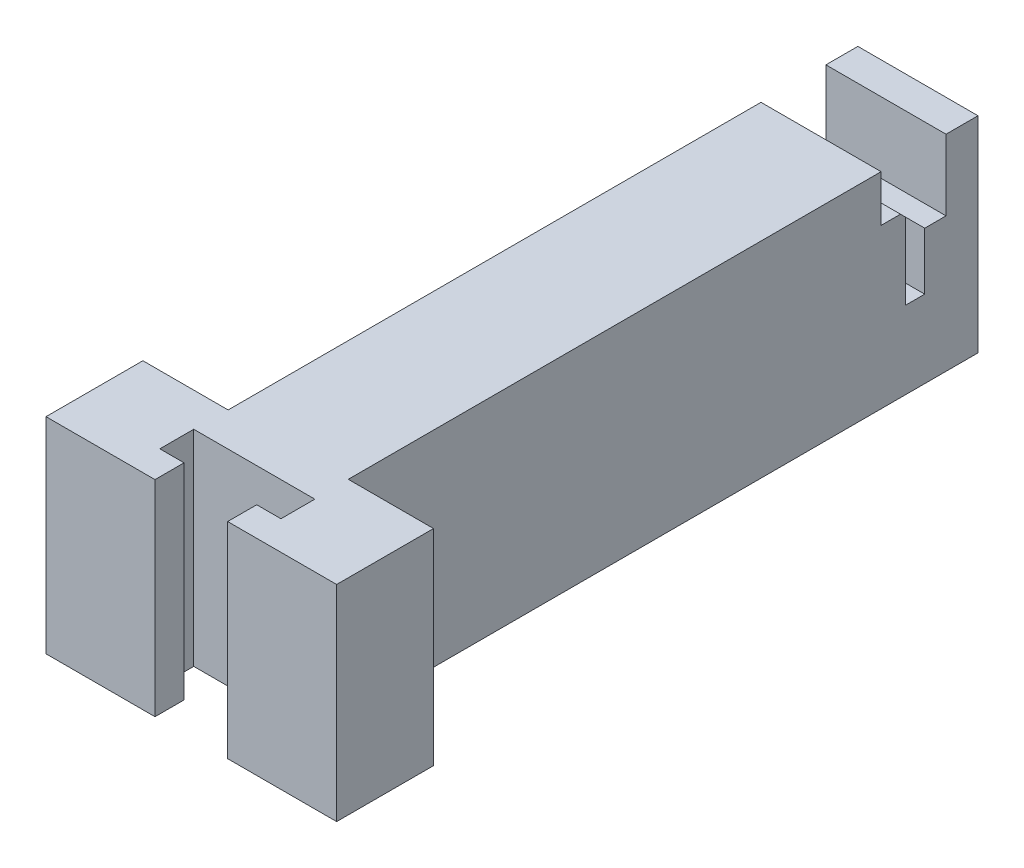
ISO-10303-21;
HEADER;
FILE_DESCRIPTION(('STEP AP214'),'2;1');
FILE_NAME('part.step','',(''),(''),'','','');
FILE_SCHEMA(('AUTOMOTIVE_DESIGN { 1 0 10303 214 1 1 1 1 }'));
ENDSEC;
DATA;
#1=APPLICATION_CONTEXT('core data for automotive mechanical design processes');
#2=APPLICATION_PROTOCOL_DEFINITION('international standard','automotive_design',2000,#1);
#3=PRODUCT_CONTEXT('',#1,'mechanical');
#4=PRODUCT('Part','Part','',(#3));
#5=PRODUCT_RELATED_PRODUCT_CATEGORY('part','',(#4));
#6=PRODUCT_DEFINITION_FORMATION('','',#4);
#7=PRODUCT_DEFINITION_CONTEXT('part definition',#1,'design');
#8=PRODUCT_DEFINITION('design','',#6,#7);
#9=PRODUCT_DEFINITION_SHAPE('','',#8);
#10=(LENGTH_UNIT() NAMED_UNIT(*) SI_UNIT(.MILLI.,.METRE.));
#11=(NAMED_UNIT(*) PLANE_ANGLE_UNIT() SI_UNIT($,.RADIAN.));
#12=(NAMED_UNIT(*) SI_UNIT($,.STERADIAN.) SOLID_ANGLE_UNIT());
#13=UNCERTAINTY_MEASURE_WITH_UNIT(LENGTH_MEASURE(1.E-05),#10,'distance_accuracy_value','');
#14=(GEOMETRIC_REPRESENTATION_CONTEXT(3) GLOBAL_UNCERTAINTY_ASSIGNED_CONTEXT((#13)) GLOBAL_UNIT_ASSIGNED_CONTEXT((#10,
#11,#12)) REPRESENTATION_CONTEXT('',''));
#15=CARTESIAN_POINT('',(0.,0.,0.));
#16=DIRECTION('',(0.,0.,1.));
#17=DIRECTION('',(1.,0.,0.));
#18=AXIS2_PLACEMENT_3D('',#15,#16,#17);
#19=CARTESIAN_POINT('',(0.,1.13686837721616E-13,75.));
#20=DIRECTION('',(1.,0.,0.));
#21=DIRECTION('',(0.,0.,-1.));
#22=AXIS2_PLACEMENT_3D('',#19,#20,#21);
#23=PLANE('',#22);
#24=DIRECTION('',(0.,1.,0.));
#25=VECTOR('',#24,1.);
#26=CARTESIAN_POINT('',(1.81898940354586E-12,-53.8,65.));
#27=LINE('',#26,#25);
#28=CARTESIAN_POINT('',(1.81898940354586E-12,1.11022302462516E-13,65.));
#29=VERTEX_POINT('',#28);
#30=CARTESIAN_POINT('',(1.81972492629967E-12,21.2,65.));
#31=VERTEX_POINT('',#30);
#32=EDGE_CURVE('E205',#29,#31,#27,.T.);
#33=ORIENTED_EDGE('',*,*,#32,.F.);
#34=DIRECTION('',(0.,0.,-1.));
#35=VECTOR('',#34,1.);
#36=CARTESIAN_POINT('',(0.,1.13686837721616E-13,75.));
#37=LINE('',#36,#35);
#38=CARTESIAN_POINT('',(0.,1.13686837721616E-13,75.));
#39=VERTEX_POINT('',#38);
#40=EDGE_CURVE('E372',#39,#29,#37,.T.);
#41=ORIENTED_EDGE('',*,*,#40,.F.);
#42=DIRECTION('',(0.,-1.,0.));
#43=VECTOR('',#42,1.);
#44=CARTESIAN_POINT('',(0.,1.13686837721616E-13,75.));
#45=LINE('',#44,#43);
#46=CARTESIAN_POINT('',(0.,21.2,75.));
#47=VERTEX_POINT('',#46);
#48=EDGE_CURVE('E346',#47,#39,#45,.T.);
#49=ORIENTED_EDGE('',*,*,#48,.F.);
#50=DIRECTION('',(0.,0.,-1.));
#51=VECTOR('',#50,1.);
#52=CARTESIAN_POINT('',(0.,21.2,75.));
#53=LINE('',#52,#51);
#54=EDGE_CURVE('E359',#47,#31,#53,.T.);
#55=ORIENTED_EDGE('',*,*,#54,.T.);
#56=EDGE_LOOP('',(#33,#41,#49,#55));
#57=FACE_BOUND('',#56,.T.);
#58=ADVANCED_FACE('F34',(#57),#23,.F.);
#59=CARTESIAN_POINT('',(30.,1.13686837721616E-13,75.));
#60=DIRECTION('',(-1.,0.,0.));
#61=DIRECTION('',(0.,0.,1.));
#62=AXIS2_PLACEMENT_3D('',#59,#60,#61);
#63=PLANE('',#62);
#64=DIRECTION('',(0.,1.,0.));
#65=VECTOR('',#64,1.);
#66=CARTESIAN_POINT('',(30.0000000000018,-53.8,65.));
#67=LINE('',#66,#65);
#68=CARTESIAN_POINT('',(30.0000000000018,1.11022302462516E-13,65.));
#69=VERTEX_POINT('',#68);
#70=CARTESIAN_POINT('',(30.0000000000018,21.2,65.));
#71=VERTEX_POINT('',#70);
#72=EDGE_CURVE('E258',#69,#71,#67,.T.);
#73=ORIENTED_EDGE('',*,*,#72,.T.);
#74=DIRECTION('',(0.,0.,-1.));
#75=VECTOR('',#74,1.);
#76=CARTESIAN_POINT('',(30.,21.2,75.));
#77=LINE('',#76,#75);
#78=CARTESIAN_POINT('',(30.,21.2,75.));
#79=VERTEX_POINT('',#78);
#80=EDGE_CURVE('E366',#79,#71,#77,.T.);
#81=ORIENTED_EDGE('',*,*,#80,.F.);
#82=DIRECTION('',(0.,1.,0.));
#83=VECTOR('',#82,1.);
#84=CARTESIAN_POINT('',(30.,1.13686837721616E-13,75.));
#85=LINE('',#84,#83);
#86=CARTESIAN_POINT('',(30.,1.13686837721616E-13,75.));
#87=VERTEX_POINT('',#86);
#88=EDGE_CURVE('E354',#87,#79,#85,.T.);
#89=ORIENTED_EDGE('',*,*,#88,.F.);
#90=DIRECTION('',(0.,0.,-1.));
#91=VECTOR('',#90,1.);
#92=CARTESIAN_POINT('',(30.,1.13686837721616E-13,75.));
#93=LINE('',#92,#91);
#94=EDGE_CURVE('E369',#87,#69,#93,.T.);
#95=ORIENTED_EDGE('',*,*,#94,.T.);
#96=EDGE_LOOP('',(#73,#81,#89,#95));
#97=FACE_BOUND('',#96,.T.);
#98=ADVANCED_FACE('F442',(#97),#63,.F.);
#99=CARTESIAN_POINT('',(0.,21.2,75.));
#100=DIRECTION('',(0.,-1.,0.));
#101=DIRECTION('',(0.,0.,-1.));
#102=AXIS2_PLACEMENT_3D('',#99,#100,#101);
#103=PLANE('',#102);
#104=DIRECTION('',(0.,0.,1.));
#105=VECTOR('',#104,1.);
#106=CARTESIAN_POINT('',(8.80000000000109,21.2,65.));
#107=LINE('',#106,#105);
#108=CARTESIAN_POINT('',(8.80000000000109,21.2,0.));
#109=VERTEX_POINT('',#108);
#110=CARTESIAN_POINT('',(8.80000000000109,21.2,3.29999999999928));
#111=VERTEX_POINT('',#110);
#112=EDGE_CURVE('E246',#109,#111,#107,.T.);
#113=ORIENTED_EDGE('',*,*,#112,.T.);
#114=DIRECTION('',(1.,0.,0.));
#115=VECTOR('',#114,1.);
#116=CARTESIAN_POINT('',(-45.,21.1999999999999,3.29999999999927));
#117=LINE('',#116,#115);
#118=CARTESIAN_POINT('',(21.2000000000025,21.2,3.29999999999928));
#119=VERTEX_POINT('',#118);
#120=EDGE_CURVE('E338',#111,#119,#117,.T.);
#121=ORIENTED_EDGE('',*,*,#120,.T.);
#122=DIRECTION('',(0.,0.,-1.));
#123=VECTOR('',#122,1.);
#124=CARTESIAN_POINT('',(21.2000000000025,21.2,65.));
#125=LINE('',#124,#123);
#126=CARTESIAN_POINT('',(21.2000000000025,21.2,0.));
#127=VERTEX_POINT('',#126);
#128=EDGE_CURVE('E241',#119,#127,#125,.T.);
#129=ORIENTED_EDGE('',*,*,#128,.T.);
#130=DIRECTION('',(-1.,0.,0.));
#131=VECTOR('',#130,1.);
#132=CARTESIAN_POINT('',(0.,21.2,0.));
#133=LINE('',#132,#131);
#134=EDGE_CURVE('E350',#127,#109,#133,.T.);
#135=ORIENTED_EDGE('',*,*,#134,.T.);
#136=EDGE_LOOP('',(#113,#121,#129,#135));
#137=FACE_BOUND('',#136,.T.);
#138=ADVANCED_FACE('F412',(#137),#103,.F.);
#139=DIRECTION('',(-1.,0.,0.));
#140=VECTOR('',#139,1.);
#141=CARTESIAN_POINT('',(1.81898940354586E-12,21.2,65.));
#142=LINE('',#141,#140);
#143=CARTESIAN_POINT('',(8.80000000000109,21.2,65.));
#144=VERTEX_POINT('',#143);
#145=EDGE_CURVE('E221',#144,#31,#142,.T.);
#146=ORIENTED_EDGE('',*,*,#145,.T.);
#147=ORIENTED_EDGE('',*,*,#54,.F.);
#148=DIRECTION('',(-1.,0.,0.));
#149=VECTOR('',#148,1.);
#150=CARTESIAN_POINT('',(0.,21.2,75.));
#151=LINE('',#150,#149);
#152=CARTESIAN_POINT('',(11.2500000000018,21.2,75.));
#153=VERTEX_POINT('',#152);
#154=EDGE_CURVE('E220',#153,#47,#151,.T.);
#155=ORIENTED_EDGE('',*,*,#154,.F.);
#156=DIRECTION('',(0.,0.,-1.));
#157=VECTOR('',#156,1.);
#158=CARTESIAN_POINT('',(11.2500000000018,21.2,75.));
#159=LINE('',#158,#157);
#160=CARTESIAN_POINT('',(11.2500000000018,21.2,72.));
#161=VERTEX_POINT('',#160);
#162=EDGE_CURVE('E48',#153,#161,#159,.T.);
#163=ORIENTED_EDGE('',*,*,#162,.T.);
#164=DIRECTION('',(-1.,0.,0.));
#165=VECTOR('',#164,1.);
#166=CARTESIAN_POINT('',(8.75000000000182,21.2,72.));
#167=LINE('',#166,#165);
#168=CARTESIAN_POINT('',(8.75000000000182,21.2,72.));
#169=VERTEX_POINT('',#168);
#170=EDGE_CURVE('E208',#161,#169,#167,.T.);
#171=ORIENTED_EDGE('',*,*,#170,.T.);
#172=DIRECTION('',(0.,0.,-1.));
#173=VECTOR('',#172,1.);
#174=CARTESIAN_POINT('',(8.75000000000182,21.2,72.));
#175=LINE('',#174,#173);
#176=CARTESIAN_POINT('',(8.75000000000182,21.2,68.5));
#177=VERTEX_POINT('',#176);
#178=EDGE_CURVE('E214',#169,#177,#175,.T.);
#179=ORIENTED_EDGE('',*,*,#178,.T.);
#180=DIRECTION('',(1.,0.,0.));
#181=VECTOR('',#180,1.);
#182=CARTESIAN_POINT('',(8.75000000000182,21.2,68.5));
#183=LINE('',#182,#181);
#184=CARTESIAN_POINT('',(21.2500000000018,21.2,68.5));
#185=VERTEX_POINT('',#184);
#186=EDGE_CURVE('E226',#177,#185,#183,.T.);
#187=ORIENTED_EDGE('',*,*,#186,.T.);
#188=DIRECTION('',(0.,0.,1.));
#189=VECTOR('',#188,1.);
#190=CARTESIAN_POINT('',(21.2500000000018,21.2,72.));
#191=LINE('',#190,#189);
#192=CARTESIAN_POINT('',(21.2500000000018,21.2,72.));
#193=VERTEX_POINT('',#192);
#194=EDGE_CURVE('E229',#185,#193,#191,.T.);
#195=ORIENTED_EDGE('',*,*,#194,.T.);
#196=DIRECTION('',(-1.,0.,0.));
#197=VECTOR('',#196,1.);
#198=CARTESIAN_POINT('',(18.7500000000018,21.2,72.));
#199=LINE('',#198,#197);
#200=CARTESIAN_POINT('',(18.7500000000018,21.2,72.));
#201=VERTEX_POINT('',#200);
#202=EDGE_CURVE('E232',#193,#201,#199,.T.);
#203=ORIENTED_EDGE('',*,*,#202,.T.);
#204=DIRECTION('',(0.,0.,1.));
#205=VECTOR('',#204,1.);
#206=CARTESIAN_POINT('',(18.7500000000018,21.2,72.));
#207=LINE('',#206,#205);
#208=CARTESIAN_POINT('',(18.7500000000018,21.2,75.));
#209=VERTEX_POINT('',#208);
#210=EDGE_CURVE('E235',#201,#209,#207,.T.);
#211=ORIENTED_EDGE('',*,*,#210,.T.);
#212=EDGE_CURVE('E356',#79,#209,#151,.T.);
#213=ORIENTED_EDGE('',*,*,#212,.F.);
#214=ORIENTED_EDGE('',*,*,#80,.T.);
#215=DIRECTION('',(-1.,0.,0.));
#216=VECTOR('',#215,1.);
#217=CARTESIAN_POINT('',(21.2000000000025,21.2,65.));
#218=LINE('',#217,#216);
#219=CARTESIAN_POINT('',(21.2000000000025,21.2,65.));
#220=VERTEX_POINT('',#219);
#221=EDGE_CURVE('E238',#71,#220,#218,.T.);
#222=ORIENTED_EDGE('',*,*,#221,.T.);
#223=CARTESIAN_POINT('',(21.2000000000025,21.2,9.99999999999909));
#224=VERTEX_POINT('',#223);
#225=EDGE_CURVE('E242',#220,#224,#125,.T.);
#226=ORIENTED_EDGE('',*,*,#225,.T.);
#227=DIRECTION('',(1.,0.,0.));
#228=VECTOR('',#227,1.);
#229=CARTESIAN_POINT('',(-45.,21.1999999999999,9.99999999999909));
#230=LINE('',#229,#228);
#231=CARTESIAN_POINT('',(8.80000000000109,21.1999999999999,9.99999999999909));
#232=VERTEX_POINT('',#231);
#233=EDGE_CURVE('E341',#232,#224,#230,.T.);
#234=ORIENTED_EDGE('',*,*,#233,.F.);
#235=EDGE_CURVE('E245',#232,#144,#107,.T.);
#236=ORIENTED_EDGE('',*,*,#235,.T.);
#237=EDGE_LOOP('',(#146,#147,#155,#163,#171,#179,#187,#195,#203,#211,#213,#214,#222,#226,#234,#236));
#238=FACE_BOUND('',#237,.T.);
#239=ADVANCED_FACE('F218',(#238),#103,.F.);
#240=CARTESIAN_POINT('',(0.,1.13686837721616E-13,75.));
#241=DIRECTION('',(0.,1.,0.));
#242=DIRECTION('',(0.,0.,1.));
#243=AXIS2_PLACEMENT_3D('',#240,#241,#242);
#244=PLANE('',#243);
#245=DIRECTION('',(-1.,0.,0.));
#246=VECTOR('',#245,1.);
#247=CARTESIAN_POINT('',(0.,1.13686837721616E-13,65.));
#248=LINE('',#247,#246);
#249=CARTESIAN_POINT('',(8.80000000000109,1.11022302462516E-13,65.));
#250=VERTEX_POINT('',#249);
#251=EDGE_CURVE('E12',#250,#29,#248,.T.);
#252=ORIENTED_EDGE('',*,*,#251,.F.);
#253=DIRECTION('',(0.,0.,1.));
#254=VECTOR('',#253,1.);
#255=CARTESIAN_POINT('',(8.80000000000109,1.13686837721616E-13,75.));
#256=LINE('',#255,#254);
#257=CARTESIAN_POINT('',(8.80000000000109,1.17961196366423E-13,0.));
#258=VERTEX_POINT('',#257);
#259=EDGE_CURVE('E313',#258,#250,#256,.T.);
#260=ORIENTED_EDGE('',*,*,#259,.F.);
#261=DIRECTION('',(1.,0.,0.));
#262=VECTOR('',#261,1.);
#263=CARTESIAN_POINT('',(0.,1.13686837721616E-13,0.));
#264=LINE('',#263,#262);
#265=CARTESIAN_POINT('',(21.2000000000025,1.17961196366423E-13,0.));
#266=VERTEX_POINT('',#265);
#267=EDGE_CURVE('E322',#258,#266,#264,.T.);
#268=ORIENTED_EDGE('',*,*,#267,.T.);
#269=DIRECTION('',(0.,0.,-1.));
#270=VECTOR('',#269,1.);
#271=CARTESIAN_POINT('',(21.2000000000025,1.13686837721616E-13,75.));
#272=LINE('',#271,#270);
#273=CARTESIAN_POINT('',(21.2000000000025,1.11022302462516E-13,65.));
#274=VERTEX_POINT('',#273);
#275=EDGE_CURVE('E290',#274,#266,#272,.T.);
#276=ORIENTED_EDGE('',*,*,#275,.F.);
#277=DIRECTION('',(-1.,0.,0.));
#278=VECTOR('',#277,1.);
#279=CARTESIAN_POINT('',(0.,1.13686837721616E-13,65.));
#280=LINE('',#279,#278);
#281=EDGE_CURVE('E41',#69,#274,#280,.T.);
#282=ORIENTED_EDGE('',*,*,#281,.F.);
#283=ORIENTED_EDGE('',*,*,#94,.F.);
#284=DIRECTION('',(1.,0.,0.));
#285=VECTOR('',#284,1.);
#286=CARTESIAN_POINT('',(0.,1.13686837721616E-13,75.));
#287=LINE('',#286,#285);
#288=CARTESIAN_POINT('',(18.7500000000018,1.17961196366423E-13,75.));
#289=VERTEX_POINT('',#288);
#290=EDGE_CURVE('E349',#289,#87,#287,.T.);
#291=ORIENTED_EDGE('',*,*,#290,.F.);
#292=DIRECTION('',(0.,0.,1.));
#293=VECTOR('',#292,1.);
#294=CARTESIAN_POINT('',(18.7500000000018,1.13686837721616E-13,75.));
#295=LINE('',#294,#293);
#296=CARTESIAN_POINT('',(18.7500000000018,1.11022302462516E-13,72.));
#297=VERTEX_POINT('',#296);
#298=EDGE_CURVE('E316',#297,#289,#295,.T.);
#299=ORIENTED_EDGE('',*,*,#298,.F.);
#300=DIRECTION('',(-1.,0.,0.));
#301=VECTOR('',#300,1.);
#302=CARTESIAN_POINT('',(0.,1.13686837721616E-13,72.));
#303=LINE('',#302,#301);
#304=CARTESIAN_POINT('',(21.2500000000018,1.11022302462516E-13,72.));
#305=VERTEX_POINT('',#304);
#306=EDGE_CURVE('E392',#305,#297,#303,.T.);
#307=ORIENTED_EDGE('',*,*,#306,.F.);
#308=DIRECTION('',(0.,0.,1.));
#309=VECTOR('',#308,1.);
#310=CARTESIAN_POINT('',(21.2500000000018,1.13686837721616E-13,75.));
#311=LINE('',#310,#309);
#312=CARTESIAN_POINT('',(21.2500000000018,1.11022302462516E-13,68.5));
#313=VERTEX_POINT('',#312);
#314=EDGE_CURVE('E390',#313,#305,#311,.T.);
#315=ORIENTED_EDGE('',*,*,#314,.F.);
#316=DIRECTION('',(1.,0.,0.));
#317=VECTOR('',#316,1.);
#318=CARTESIAN_POINT('',(0.,1.13686837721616E-13,68.5));
#319=LINE('',#318,#317);
#320=CARTESIAN_POINT('',(8.75000000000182,1.11022302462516E-13,68.5));
#321=VERTEX_POINT('',#320);
#322=EDGE_CURVE('E388',#321,#313,#319,.T.);
#323=ORIENTED_EDGE('',*,*,#322,.F.);
#324=DIRECTION('',(0.,0.,-1.));
#325=VECTOR('',#324,1.);
#326=CARTESIAN_POINT('',(8.75000000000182,1.13686837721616E-13,75.));
#327=LINE('',#326,#325);
#328=CARTESIAN_POINT('',(8.75000000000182,1.11022302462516E-13,72.));
#329=VERTEX_POINT('',#328);
#330=EDGE_CURVE('E386',#329,#321,#327,.T.);
#331=ORIENTED_EDGE('',*,*,#330,.F.);
#332=DIRECTION('',(-1.,0.,0.));
#333=VECTOR('',#332,1.);
#334=CARTESIAN_POINT('',(0.,1.13686837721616E-13,72.));
#335=LINE('',#334,#333);
#336=CARTESIAN_POINT('',(11.2500000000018,1.11022302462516E-13,72.));
#337=VERTEX_POINT('',#336);
#338=EDGE_CURVE('E384',#337,#329,#335,.T.);
#339=ORIENTED_EDGE('',*,*,#338,.F.);
#340=DIRECTION('',(0.,0.,-1.));
#341=VECTOR('',#340,1.);
#342=CARTESIAN_POINT('',(11.2500000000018,1.13686837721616E-13,75.));
#343=LINE('',#342,#341);
#344=CARTESIAN_POINT('',(11.2500000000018,1.17961196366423E-13,75.));
#345=VERTEX_POINT('',#344);
#346=EDGE_CURVE('E201',#345,#337,#343,.T.);
#347=ORIENTED_EDGE('',*,*,#346,.F.);
#348=EDGE_CURVE('E351',#39,#345,#287,.T.);
#349=ORIENTED_EDGE('',*,*,#348,.F.);
#350=ORIENTED_EDGE('',*,*,#40,.T.);
#351=EDGE_LOOP('',(#252,#260,#268,#276,#282,#283,#291,#299,#307,#315,#323,#331,#339,#347,#349,#350));
#352=FACE_BOUND('',#351,.T.);
#353=ADVANCED_FACE('F404',(#352),#244,.F.);
#354=CARTESIAN_POINT('',(0.,21.2,75.));
#355=DIRECTION('',(0.,0.,-1.));
#356=DIRECTION('',(-1.,0.,0.));
#357=AXIS2_PLACEMENT_3D('',#354,#355,#356);
#358=PLANE('',#357);
#359=DIRECTION('',(0.,1.,0.));
#360=VECTOR('',#359,1.);
#361=CARTESIAN_POINT('',(18.7500000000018,21.2,75.));
#362=LINE('',#361,#360);
#363=EDGE_CURVE('E382',#289,#209,#362,.T.);
#364=ORIENTED_EDGE('',*,*,#363,.F.);
#365=ORIENTED_EDGE('',*,*,#290,.T.);
#366=ORIENTED_EDGE('',*,*,#88,.T.);
#367=ORIENTED_EDGE('',*,*,#212,.T.);
#368=EDGE_LOOP('',(#364,#365,#366,#367));
#369=FACE_BOUND('',#368,.T.);
#370=ADVANCED_FACE('F449',(#369),#358,.F.);
#371=DIRECTION('',(0.,-1.,0.));
#372=VECTOR('',#371,1.);
#373=CARTESIAN_POINT('',(11.2500000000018,21.2,75.));
#374=LINE('',#373,#372);
#375=EDGE_CURVE('E380',#153,#345,#374,.T.);
#376=ORIENTED_EDGE('',*,*,#375,.F.);
#377=ORIENTED_EDGE('',*,*,#154,.T.);
#378=ORIENTED_EDGE('',*,*,#48,.T.);
#379=ORIENTED_EDGE('',*,*,#348,.T.);
#380=EDGE_LOOP('',(#376,#377,#378,#379));
#381=FACE_BOUND('',#380,.T.);
#382=ADVANCED_FACE('F472',(#381),#358,.F.);
#383=CARTESIAN_POINT('',(0.,21.2,0.));
#384=DIRECTION('',(0.,0.,-1.));
#385=DIRECTION('',(-1.,0.,0.));
#386=AXIS2_PLACEMENT_3D('',#383,#384,#385);
#387=PLANE('',#386);
#388=ORIENTED_EDGE('',*,*,#267,.F.);
#389=DIRECTION('',(0.,1.,0.));
#390=VECTOR('',#389,1.);
#391=CARTESIAN_POINT('',(8.80000000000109,-53.8,0.));
#392=LINE('',#391,#390);
#393=EDGE_CURVE('E251',#258,#109,#392,.T.);
#394=ORIENTED_EDGE('',*,*,#393,.T.);
#395=ORIENTED_EDGE('',*,*,#134,.F.);
#396=DIRECTION('',(0.,1.,0.));
#397=VECTOR('',#396,1.);
#398=CARTESIAN_POINT('',(21.2000000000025,-53.8,0.));
#399=LINE('',#398,#397);
#400=EDGE_CURVE('E254',#266,#127,#399,.T.);
#401=ORIENTED_EDGE('',*,*,#400,.F.);
#402=EDGE_LOOP('',(#388,#394,#395,#401));
#403=FACE_BOUND('',#402,.T.);
#404=ADVANCED_FACE('F408',(#403),#387,.T.);
#405=CARTESIAN_POINT('',(-45.,16.4000000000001,9.99999999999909));
#406=DIRECTION('',(0.,1.,0.));
#407=DIRECTION('',(0.,0.,1.));
#408=AXIS2_PLACEMENT_3D('',#405,#406,#407);
#409=PLANE('',#408);
#410=DIRECTION('',(1.,0.,0.));
#411=VECTOR('',#410,1.);
#412=CARTESIAN_POINT('',(-45.,16.4000000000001,7.99999999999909));
#413=LINE('',#412,#411);
#414=CARTESIAN_POINT('',(8.80000000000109,16.4000000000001,7.99999999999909));
#415=VERTEX_POINT('',#414);
#416=CARTESIAN_POINT('',(21.2000000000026,16.4000000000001,7.99999999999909));
#417=VERTEX_POINT('',#416);
#418=EDGE_CURVE('E319',#415,#417,#413,.T.);
#419=ORIENTED_EDGE('',*,*,#418,.F.);
#420=DIRECTION('',(0.,0.,1.));
#421=VECTOR('',#420,1.);
#422=CARTESIAN_POINT('',(8.80000000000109,16.4000000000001,9.99999999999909));
#423=LINE('',#422,#421);
#424=CARTESIAN_POINT('',(8.80000000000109,16.4000000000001,9.99999999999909));
#425=VERTEX_POINT('',#424);
#426=EDGE_CURVE('E292',#415,#425,#423,.T.);
#427=ORIENTED_EDGE('',*,*,#426,.T.);
#428=DIRECTION('',(1.,0.,0.));
#429=VECTOR('',#428,1.);
#430=CARTESIAN_POINT('',(-45.,16.4000000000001,9.99999999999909));
#431=LINE('',#430,#429);
#432=CARTESIAN_POINT('',(21.2000000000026,16.4000000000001,9.99999999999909));
#433=VERTEX_POINT('',#432);
#434=EDGE_CURVE('E318',#425,#433,#431,.T.);
#435=ORIENTED_EDGE('',*,*,#434,.T.);
#436=DIRECTION('',(0.,0.,-1.));
#437=VECTOR('',#436,1.);
#438=CARTESIAN_POINT('',(21.2000000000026,16.4000000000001,9.99999999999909));
#439=LINE('',#438,#437);
#440=EDGE_CURVE('E56',#433,#417,#439,.T.);
#441=ORIENTED_EDGE('',*,*,#440,.T.);
#442=EDGE_LOOP('',(#419,#427,#435,#441));
#443=FACE_BOUND('',#442,.T.);
#444=ADVANCED_FACE('F433',(#443),#409,.T.);
#445=CARTESIAN_POINT('',(-45.,16.4000000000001,7.99999999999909));
#446=DIRECTION('',(0.,0.707106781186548,-0.707106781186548));
#447=DIRECTION('',(0.,0.707106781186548,0.707106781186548));
#448=AXIS2_PLACEMENT_3D('',#445,#446,#447);
#449=PLANE('',#448);
#450=DIRECTION('',(1.,0.,0.));
#451=VECTOR('',#450,1.);
#452=CARTESIAN_POINT('',(-45.,15.9000000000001,7.49999999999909));
#453=LINE('',#452,#451);
#454=CARTESIAN_POINT('',(8.80000000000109,15.9000000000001,7.49999999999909));
#455=VERTEX_POINT('',#454);
#456=CARTESIAN_POINT('',(21.2000000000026,15.9000000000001,7.49999999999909));
#457=VERTEX_POINT('',#456);
#458=EDGE_CURVE('E323',#455,#457,#453,.T.);
#459=ORIENTED_EDGE('',*,*,#458,.F.);
#460=DIRECTION('',(0.,0.707106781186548,0.707106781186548));
#461=VECTOR('',#460,1.);
#462=CARTESIAN_POINT('',(8.80000000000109,16.4000000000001,7.99999999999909));
#463=LINE('',#462,#461);
#464=EDGE_CURVE('E295',#455,#415,#463,.T.);
#465=ORIENTED_EDGE('',*,*,#464,.T.);
#466=ORIENTED_EDGE('',*,*,#418,.T.);
#467=DIRECTION('',(0.,-0.707106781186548,-0.707106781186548));
#468=VECTOR('',#467,1.);
#469=CARTESIAN_POINT('',(21.2000000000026,16.4000000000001,7.99999999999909));
#470=LINE('',#469,#468);
#471=EDGE_CURVE('E272',#417,#457,#470,.T.);
#472=ORIENTED_EDGE('',*,*,#471,.T.);
#473=EDGE_LOOP('',(#459,#465,#466,#472));
#474=FACE_BOUND('',#473,.T.);
#475=ADVANCED_FACE('F430',(#474),#449,.T.);
#476=CARTESIAN_POINT('',(-45.,8.,7.49999999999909));
#477=DIRECTION('',(0.,0.,-1.));
#478=DIRECTION('',(-1.,0.,0.));
#479=AXIS2_PLACEMENT_3D('',#476,#477,#478);
#480=PLANE('',#479);
#481=DIRECTION('',(1.,0.,0.));
#482=VECTOR('',#481,1.);
#483=CARTESIAN_POINT('',(-45.,8.,7.49999999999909));
#484=LINE('',#483,#482);
#485=CARTESIAN_POINT('',(8.80000000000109,8.,7.49999999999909));
#486=VERTEX_POINT('',#485);
#487=CARTESIAN_POINT('',(21.2000000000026,8.,7.49999999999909));
#488=VERTEX_POINT('',#487);
#489=EDGE_CURVE('E326',#486,#488,#484,.T.);
#490=ORIENTED_EDGE('',*,*,#489,.F.);
#491=DIRECTION('',(0.,1.,0.));
#492=VECTOR('',#491,1.);
#493=CARTESIAN_POINT('',(8.80000000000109,8.,7.49999999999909));
#494=LINE('',#493,#492);
#495=EDGE_CURVE('E298',#486,#455,#494,.T.);
#496=ORIENTED_EDGE('',*,*,#495,.T.);
#497=ORIENTED_EDGE('',*,*,#458,.T.);
#498=DIRECTION('',(0.,-1.,0.));
#499=VECTOR('',#498,1.);
#500=CARTESIAN_POINT('',(21.2000000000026,8.,7.49999999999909));
#501=LINE('',#500,#499);
#502=EDGE_CURVE('E275',#457,#488,#501,.T.);
#503=ORIENTED_EDGE('',*,*,#502,.T.);
#504=EDGE_LOOP('',(#490,#496,#497,#503));
#505=FACE_BOUND('',#504,.T.);
#506=ADVANCED_FACE('F427',(#505),#480,.T.);
#507=CARTESIAN_POINT('',(-45.,8.,7.49999999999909));
#508=DIRECTION('',(0.,1.,0.));
#509=DIRECTION('',(0.,0.,1.));
#510=AXIS2_PLACEMENT_3D('',#507,#508,#509);
#511=PLANE('',#510);
#512=DIRECTION('',(1.,0.,0.));
#513=VECTOR('',#512,1.);
#514=CARTESIAN_POINT('',(-45.,8.,5.49999999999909));
#515=LINE('',#514,#513);
#516=CARTESIAN_POINT('',(8.80000000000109,8.,5.49999999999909));
#517=VERTEX_POINT('',#516);
#518=CARTESIAN_POINT('',(21.2000000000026,8.,5.49999999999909));
#519=VERTEX_POINT('',#518);
#520=EDGE_CURVE('E329',#517,#519,#515,.T.);
#521=ORIENTED_EDGE('',*,*,#520,.F.);
#522=DIRECTION('',(0.,0.,1.));
#523=VECTOR('',#522,1.);
#524=CARTESIAN_POINT('',(8.80000000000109,8.,7.49999999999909));
#525=LINE('',#524,#523);
#526=EDGE_CURVE('E301',#517,#486,#525,.T.);
#527=ORIENTED_EDGE('',*,*,#526,.T.);
#528=ORIENTED_EDGE('',*,*,#489,.T.);
#529=DIRECTION('',(0.,0.,-1.));
#530=VECTOR('',#529,1.);
#531=CARTESIAN_POINT('',(21.2000000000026,8.,7.49999999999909));
#532=LINE('',#531,#530);
#533=EDGE_CURVE('E278',#488,#519,#532,.T.);
#534=ORIENTED_EDGE('',*,*,#533,.T.);
#535=EDGE_LOOP('',(#521,#527,#528,#534));
#536=FACE_BOUND('',#535,.T.);
#537=ADVANCED_FACE('F424',(#536),#511,.T.);
#538=CARTESIAN_POINT('',(-45.,8.,5.49999999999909));
#539=DIRECTION('',(0.,-1.54066966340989E-13,1.));
#540=DIRECTION('',(0.,-1.,-1.54066966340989E-13));
#541=AXIS2_PLACEMENT_3D('',#538,#539,#540);
#542=PLANE('',#541);
#543=DIRECTION('',(1.,0.,0.));
#544=VECTOR('',#543,1.);
#545=CARTESIAN_POINT('',(-45.,13.9000000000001,5.5));
#546=LINE('',#545,#544);
#547=CARTESIAN_POINT('',(8.80000000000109,13.9000000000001,5.5));
#548=VERTEX_POINT('',#547);
#549=CARTESIAN_POINT('',(21.2000000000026,13.9000000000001,5.5));
#550=VERTEX_POINT('',#549);
#551=EDGE_CURVE('E332',#548,#550,#546,.T.);
#552=ORIENTED_EDGE('',*,*,#551,.F.);
#553=DIRECTION('',(0.,-1.,-1.54066966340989E-13));
#554=VECTOR('',#553,1.);
#555=CARTESIAN_POINT('',(8.80000000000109,8.,5.49999999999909));
#556=LINE('',#555,#554);
#557=EDGE_CURVE('E304',#548,#517,#556,.T.);
#558=ORIENTED_EDGE('',*,*,#557,.T.);
#559=ORIENTED_EDGE('',*,*,#520,.T.);
#560=DIRECTION('',(0.,1.,1.54066966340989E-13));
#561=VECTOR('',#560,1.);
#562=CARTESIAN_POINT('',(21.2000000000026,8.,5.49999999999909));
#563=LINE('',#562,#561);
#564=EDGE_CURVE('E281',#519,#550,#563,.T.);
#565=ORIENTED_EDGE('',*,*,#564,.T.);
#566=EDGE_LOOP('',(#552,#558,#559,#565));
#567=FACE_BOUND('',#566,.T.);
#568=ADVANCED_FACE('F421',(#567),#542,.T.);
#569=CARTESIAN_POINT('',(-45.,13.9000000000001,5.5));
#570=DIRECTION('',(0.,1.,0.));
#571=DIRECTION('',(0.,0.,1.));
#572=AXIS2_PLACEMENT_3D('',#569,#570,#571);
#573=PLANE('',#572);
#574=DIRECTION('',(1.,0.,0.));
#575=VECTOR('',#574,1.);
#576=CARTESIAN_POINT('',(-45.,13.9000000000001,3.29999999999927));
#577=LINE('',#576,#575);
#578=CARTESIAN_POINT('',(8.80000000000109,13.9000000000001,3.29999999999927));
#579=VERTEX_POINT('',#578);
#580=CARTESIAN_POINT('',(21.2000000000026,13.9000000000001,3.29999999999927));
#581=VERTEX_POINT('',#580);
#582=EDGE_CURVE('E335',#579,#581,#577,.T.);
#583=ORIENTED_EDGE('',*,*,#582,.F.);
#584=DIRECTION('',(0.,0.,1.));
#585=VECTOR('',#584,1.);
#586=CARTESIAN_POINT('',(8.80000000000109,13.9000000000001,5.5));
#587=LINE('',#586,#585);
#588=EDGE_CURVE('E307',#579,#548,#587,.T.);
#589=ORIENTED_EDGE('',*,*,#588,.T.);
#590=ORIENTED_EDGE('',*,*,#551,.T.);
#591=DIRECTION('',(0.,0.,-1.));
#592=VECTOR('',#591,1.);
#593=CARTESIAN_POINT('',(21.2000000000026,13.9000000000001,5.5));
#594=LINE('',#593,#592);
#595=EDGE_CURVE('E284',#550,#581,#594,.T.);
#596=ORIENTED_EDGE('',*,*,#595,.T.);
#597=EDGE_LOOP('',(#583,#589,#590,#596));
#598=FACE_BOUND('',#597,.T.);
#599=ADVANCED_FACE('F418',(#598),#573,.T.);
#600=CARTESIAN_POINT('',(-45.,13.9000000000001,3.29999999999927));
#601=DIRECTION('',(0.,0.,1.));
#602=DIRECTION('',(1.,0.,0.));
#603=AXIS2_PLACEMENT_3D('',#600,#601,#602);
#604=PLANE('',#603);
#605=ORIENTED_EDGE('',*,*,#120,.F.);
#606=DIRECTION('',(0.,-1.,0.));
#607=VECTOR('',#606,1.);
#608=CARTESIAN_POINT('',(8.80000000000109,13.9000000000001,3.29999999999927));
#609=LINE('',#608,#607);
#610=EDGE_CURVE('E310',#111,#579,#609,.T.);
#611=ORIENTED_EDGE('',*,*,#610,.T.);
#612=ORIENTED_EDGE('',*,*,#582,.T.);
#613=DIRECTION('',(0.,1.,0.));
#614=VECTOR('',#613,1.);
#615=CARTESIAN_POINT('',(21.2000000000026,13.9000000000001,3.29999999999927));
#616=LINE('',#615,#614);
#617=EDGE_CURVE('E287',#581,#119,#616,.T.);
#618=ORIENTED_EDGE('',*,*,#617,.T.);
#619=EDGE_LOOP('',(#605,#611,#612,#618));
#620=FACE_BOUND('',#619,.T.);
#621=ADVANCED_FACE('F415',(#620),#604,.T.);
#622=CARTESIAN_POINT('',(-45.,16.4000000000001,9.99999999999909));
#623=DIRECTION('',(0.,0.,-1.));
#624=DIRECTION('',(-1.,0.,0.));
#625=AXIS2_PLACEMENT_3D('',#622,#623,#624);
#626=PLANE('',#625);
#627=ORIENTED_EDGE('',*,*,#434,.F.);
#628=DIRECTION('',(0.,1.,0.));
#629=VECTOR('',#628,1.);
#630=CARTESIAN_POINT('',(8.80000000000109,16.4000000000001,9.99999999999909));
#631=LINE('',#630,#629);
#632=EDGE_CURVE('E377',#425,#232,#631,.T.);
#633=ORIENTED_EDGE('',*,*,#632,.T.);
#634=ORIENTED_EDGE('',*,*,#233,.T.);
#635=DIRECTION('',(0.,-1.,0.));
#636=VECTOR('',#635,1.);
#637=CARTESIAN_POINT('',(21.2000000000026,16.4000000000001,9.99999999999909));
#638=LINE('',#637,#636);
#639=EDGE_CURVE('E375',#224,#433,#638,.T.);
#640=ORIENTED_EDGE('',*,*,#639,.T.);
#641=EDGE_LOOP('',(#627,#633,#634,#640));
#642=FACE_BOUND('',#641,.T.);
#643=ADVANCED_FACE('F436',(#642),#626,.T.);
#644=CARTESIAN_POINT('',(21.2000000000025,-53.8,65.));
#645=DIRECTION('',(1.,0.,0.));
#646=DIRECTION('',(0.,0.,-1.));
#647=AXIS2_PLACEMENT_3D('',#644,#645,#646);
#648=PLANE('',#647);
#649=ORIENTED_EDGE('',*,*,#275,.T.);
#650=ORIENTED_EDGE('',*,*,#400,.T.);
#651=ORIENTED_EDGE('',*,*,#128,.F.);
#652=ORIENTED_EDGE('',*,*,#617,.F.);
#653=ORIENTED_EDGE('',*,*,#595,.F.);
#654=ORIENTED_EDGE('',*,*,#564,.F.);
#655=ORIENTED_EDGE('',*,*,#533,.F.);
#656=ORIENTED_EDGE('',*,*,#502,.F.);
#657=ORIENTED_EDGE('',*,*,#471,.F.);
#658=ORIENTED_EDGE('',*,*,#440,.F.);
#659=ORIENTED_EDGE('',*,*,#639,.F.);
#660=ORIENTED_EDGE('',*,*,#225,.F.);
#661=DIRECTION('',(0.,1.,0.));
#662=VECTOR('',#661,1.);
#663=CARTESIAN_POINT('',(21.2000000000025,-53.8,65.));
#664=LINE('',#663,#662);
#665=EDGE_CURVE('E256',#274,#220,#664,.T.);
#666=ORIENTED_EDGE('',*,*,#665,.F.);
#667=EDGE_LOOP('',(#649,#650,#651,#652,#653,#654,#655,#656,#657,#658,#659,#660,#666));
#668=FACE_BOUND('',#667,.T.);
#669=ADVANCED_FACE('F401',(#668),#648,.T.);
#670=CARTESIAN_POINT('',(21.2000000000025,-53.8,65.));
#671=DIRECTION('',(0.,0.,-1.));
#672=DIRECTION('',(-1.,0.,0.));
#673=AXIS2_PLACEMENT_3D('',#670,#671,#672);
#674=PLANE('',#673);
#675=ORIENTED_EDGE('',*,*,#281,.T.);
#676=ORIENTED_EDGE('',*,*,#665,.T.);
#677=ORIENTED_EDGE('',*,*,#221,.F.);
#678=ORIENTED_EDGE('',*,*,#72,.F.);
#679=EDGE_LOOP('',(#675,#676,#677,#678));
#680=FACE_BOUND('',#679,.T.);
#681=ADVANCED_FACE('F396',(#680),#674,.T.);
#682=CARTESIAN_POINT('',(8.80000000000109,-53.8,65.));
#683=DIRECTION('',(-1.,0.,0.));
#684=DIRECTION('',(0.,0.,1.));
#685=AXIS2_PLACEMENT_3D('',#682,#683,#684);
#686=PLANE('',#685);
#687=ORIENTED_EDGE('',*,*,#259,.T.);
#688=DIRECTION('',(0.,1.,0.));
#689=VECTOR('',#688,1.);
#690=CARTESIAN_POINT('',(8.80000000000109,-53.8,65.));
#691=LINE('',#690,#689);
#692=EDGE_CURVE('E249',#250,#144,#691,.T.);
#693=ORIENTED_EDGE('',*,*,#692,.T.);
#694=ORIENTED_EDGE('',*,*,#235,.F.);
#695=ORIENTED_EDGE('',*,*,#632,.F.);
#696=ORIENTED_EDGE('',*,*,#426,.F.);
#697=ORIENTED_EDGE('',*,*,#464,.F.);
#698=ORIENTED_EDGE('',*,*,#495,.F.);
#699=ORIENTED_EDGE('',*,*,#526,.F.);
#700=ORIENTED_EDGE('',*,*,#557,.F.);
#701=ORIENTED_EDGE('',*,*,#588,.F.);
#702=ORIENTED_EDGE('',*,*,#610,.F.);
#703=ORIENTED_EDGE('',*,*,#112,.F.);
#704=ORIENTED_EDGE('',*,*,#393,.F.);
#705=EDGE_LOOP('',(#687,#693,#694,#695,#696,#697,#698,#699,#700,#701,#702,#703,#704));
#706=FACE_BOUND('',#705,.T.);
#707=ADVANCED_FACE('F482',(#706),#686,.T.);
#708=CARTESIAN_POINT('',(1.81898940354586E-12,-53.8,65.));
#709=DIRECTION('',(0.,0.,-1.));
#710=DIRECTION('',(-1.,0.,0.));
#711=AXIS2_PLACEMENT_3D('',#708,#709,#710);
#712=PLANE('',#711);
#713=ORIENTED_EDGE('',*,*,#251,.T.);
#714=ORIENTED_EDGE('',*,*,#32,.T.);
#715=ORIENTED_EDGE('',*,*,#145,.F.);
#716=ORIENTED_EDGE('',*,*,#692,.F.);
#717=EDGE_LOOP('',(#713,#714,#715,#716));
#718=FACE_BOUND('',#717,.T.);
#719=ADVANCED_FACE('F479',(#718),#712,.T.);
#720=CARTESIAN_POINT('',(18.7500000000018,-53.8,72.));
#721=DIRECTION('',(0.,0.,-1.));
#722=DIRECTION('',(-1.,0.,0.));
#723=AXIS2_PLACEMENT_3D('',#720,#721,#722);
#724=PLANE('',#723);
#725=ORIENTED_EDGE('',*,*,#306,.T.);
#726=DIRECTION('',(0.,1.,0.));
#727=VECTOR('',#726,1.);
#728=CARTESIAN_POINT('',(18.7500000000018,-53.8,72.));
#729=LINE('',#728,#727);
#730=EDGE_CURVE('E261',#297,#201,#729,.T.);
#731=ORIENTED_EDGE('',*,*,#730,.T.);
#732=ORIENTED_EDGE('',*,*,#202,.F.);
#733=DIRECTION('',(0.,1.,0.));
#734=VECTOR('',#733,1.);
#735=CARTESIAN_POINT('',(21.2500000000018,-53.8,72.));
#736=LINE('',#735,#734);
#737=EDGE_CURVE('E263',#305,#193,#736,.T.);
#738=ORIENTED_EDGE('',*,*,#737,.F.);
#739=EDGE_LOOP('',(#725,#731,#732,#738));
#740=FACE_BOUND('',#739,.T.);
#741=ADVANCED_FACE('F458',(#740),#724,.T.);
#742=CARTESIAN_POINT('',(21.2500000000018,-53.8,72.));
#743=DIRECTION('',(-1.,0.,0.));
#744=DIRECTION('',(0.,0.,1.));
#745=AXIS2_PLACEMENT_3D('',#742,#743,#744);
#746=PLANE('',#745);
#747=ORIENTED_EDGE('',*,*,#314,.T.);
#748=ORIENTED_EDGE('',*,*,#737,.T.);
#749=ORIENTED_EDGE('',*,*,#194,.F.);
#750=DIRECTION('',(0.,1.,0.));
#751=VECTOR('',#750,1.);
#752=CARTESIAN_POINT('',(21.2500000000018,-53.8,68.5));
#753=LINE('',#752,#751);
#754=EDGE_CURVE('E265',#313,#185,#753,.T.);
#755=ORIENTED_EDGE('',*,*,#754,.F.);
#756=EDGE_LOOP('',(#747,#748,#749,#755));
#757=FACE_BOUND('',#756,.T.);
#758=ADVANCED_FACE('F464',(#757),#746,.T.);
#759=CARTESIAN_POINT('',(8.75000000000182,-53.8,68.5));
#760=DIRECTION('',(0.,0.,1.));
#761=DIRECTION('',(1.,0.,0.));
#762=AXIS2_PLACEMENT_3D('',#759,#760,#761);
#763=PLANE('',#762);
#764=ORIENTED_EDGE('',*,*,#322,.T.);
#765=ORIENTED_EDGE('',*,*,#754,.T.);
#766=ORIENTED_EDGE('',*,*,#186,.F.);
#767=DIRECTION('',(0.,1.,0.));
#768=VECTOR('',#767,1.);
#769=CARTESIAN_POINT('',(8.75000000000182,-53.8,68.5));
#770=LINE('',#769,#768);
#771=EDGE_CURVE('E267',#321,#177,#770,.T.);
#772=ORIENTED_EDGE('',*,*,#771,.F.);
#773=EDGE_LOOP('',(#764,#765,#766,#772));
#774=FACE_BOUND('',#773,.T.);
#775=ADVANCED_FACE('F467',(#774),#763,.T.);
#776=CARTESIAN_POINT('',(8.75000000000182,-53.8,72.));
#777=DIRECTION('',(1.,0.,0.));
#778=DIRECTION('',(0.,0.,-1.));
#779=AXIS2_PLACEMENT_3D('',#776,#777,#778);
#780=PLANE('',#779);
#781=ORIENTED_EDGE('',*,*,#330,.T.);
#782=ORIENTED_EDGE('',*,*,#771,.T.);
#783=ORIENTED_EDGE('',*,*,#178,.F.);
#784=DIRECTION('',(0.,1.,0.));
#785=VECTOR('',#784,1.);
#786=CARTESIAN_POINT('',(8.75000000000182,-53.8,72.));
#787=LINE('',#786,#785);
#788=EDGE_CURVE('E204',#329,#169,#787,.T.);
#789=ORIENTED_EDGE('',*,*,#788,.F.);
#790=EDGE_LOOP('',(#781,#782,#783,#789));
#791=FACE_BOUND('',#790,.T.);
#792=ADVANCED_FACE('F470',(#791),#780,.T.);
#793=CARTESIAN_POINT('',(8.75000000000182,-53.8,72.));
#794=DIRECTION('',(0.,0.,-1.));
#795=DIRECTION('',(-1.,0.,0.));
#796=AXIS2_PLACEMENT_3D('',#793,#794,#795);
#797=PLANE('',#796);
#798=ORIENTED_EDGE('',*,*,#338,.T.);
#799=ORIENTED_EDGE('',*,*,#788,.T.);
#800=ORIENTED_EDGE('',*,*,#170,.F.);
#801=DIRECTION('',(0.,1.,0.));
#802=VECTOR('',#801,1.);
#803=CARTESIAN_POINT('',(11.2500000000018,-53.8,72.));
#804=LINE('',#803,#802);
#805=EDGE_CURVE('E197',#337,#161,#804,.T.);
#806=ORIENTED_EDGE('',*,*,#805,.F.);
#807=EDGE_LOOP('',(#798,#799,#800,#806));
#808=FACE_BOUND('',#807,.T.);
#809=ADVANCED_FACE('F209',(#808),#797,.T.);
#810=CARTESIAN_POINT('',(18.7500000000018,-53.8,72.));
#811=DIRECTION('',(-1.,0.,0.));
#812=DIRECTION('',(0.,0.,1.));
#813=AXIS2_PLACEMENT_3D('',#810,#811,#812);
#814=PLANE('',#813);
#815=ORIENTED_EDGE('',*,*,#298,.T.);
#816=ORIENTED_EDGE('',*,*,#363,.T.);
#817=ORIENTED_EDGE('',*,*,#210,.F.);
#818=ORIENTED_EDGE('',*,*,#730,.F.);
#819=EDGE_LOOP('',(#815,#816,#817,#818));
#820=FACE_BOUND('',#819,.T.);
#821=ADVANCED_FACE('F452',(#820),#814,.T.);
#822=CARTESIAN_POINT('',(11.2500000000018,-53.8,75.));
#823=DIRECTION('',(1.,0.,0.));
#824=DIRECTION('',(0.,0.,-1.));
#825=AXIS2_PLACEMENT_3D('',#822,#823,#824);
#826=PLANE('',#825);
#827=ORIENTED_EDGE('',*,*,#346,.T.);
#828=ORIENTED_EDGE('',*,*,#805,.T.);
#829=ORIENTED_EDGE('',*,*,#162,.F.);
#830=ORIENTED_EDGE('',*,*,#375,.T.);
#831=EDGE_LOOP('',(#827,#828,#829,#830));
#832=FACE_BOUND('',#831,.T.);
#833=ADVANCED_FACE('F199',(#832),#826,.T.);
#834=CLOSED_SHELL('',(#58,#98,#138,#239,#353,#370,#382,#404,#444,#475,#506,#537,#568,#599,#621,
#643,#669,#681,#707,#719,#741,#758,#775,#792,#809,#821,#833));
#835=MANIFOLD_SOLID_BREP('B2',#834);
#836=ADVANCED_BREP_SHAPE_REPRESENTATION('',(#18,#835),#14);
#837=SHAPE_DEFINITION_REPRESENTATION(#9,#836);
ENDSEC;
END-ISO-10303-21;
